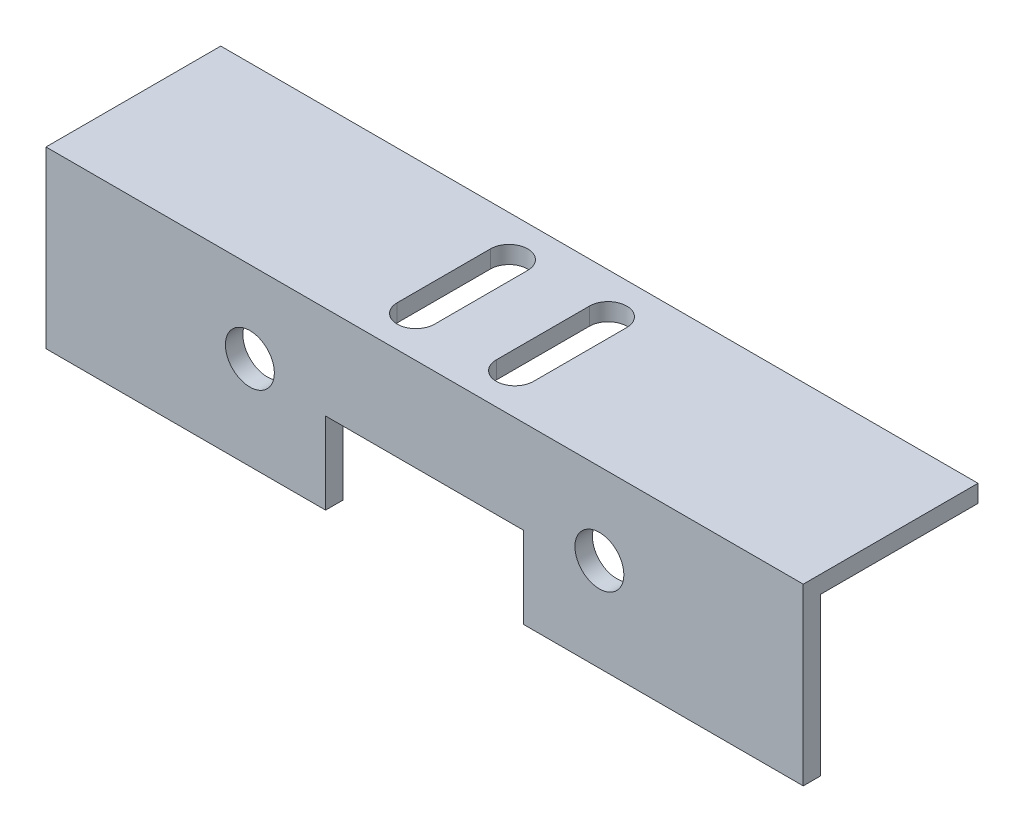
ISO-10303-21;
HEADER;
FILE_DESCRIPTION(('STEP AP214'),'2;1');
FILE_NAME('part.step','',(''),(''),'','','');
FILE_SCHEMA(('AUTOMOTIVE_DESIGN { 1 0 10303 214 1 1 1 1 }'));
ENDSEC;
DATA;
#1=APPLICATION_CONTEXT('core data for automotive mechanical design processes');
#2=APPLICATION_PROTOCOL_DEFINITION('international standard','automotive_design',2000,#1);
#3=PRODUCT_CONTEXT('',#1,'mechanical');
#4=PRODUCT('Part','Part','',(#3));
#5=PRODUCT_RELATED_PRODUCT_CATEGORY('part','',(#4));
#6=PRODUCT_DEFINITION_FORMATION('','',#4);
#7=PRODUCT_DEFINITION_CONTEXT('part definition',#1,'design');
#8=PRODUCT_DEFINITION('design','',#6,#7);
#9=PRODUCT_DEFINITION_SHAPE('','',#8);
#10=(LENGTH_UNIT() NAMED_UNIT(*) SI_UNIT(.MILLI.,.METRE.));
#11=(NAMED_UNIT(*) PLANE_ANGLE_UNIT() SI_UNIT($,.RADIAN.));
#12=(NAMED_UNIT(*) SI_UNIT($,.STERADIAN.) SOLID_ANGLE_UNIT());
#13=UNCERTAINTY_MEASURE_WITH_UNIT(LENGTH_MEASURE(1.E-05),#10,'distance_accuracy_value','');
#14=(GEOMETRIC_REPRESENTATION_CONTEXT(3) GLOBAL_UNCERTAINTY_ASSIGNED_CONTEXT((#13)) GLOBAL_UNIT_ASSIGNED_CONTEXT((#10,
#11,#12)) REPRESENTATION_CONTEXT('',''));
#15=CARTESIAN_POINT('',(0.,0.,0.));
#16=DIRECTION('',(0.,0.,1.));
#17=DIRECTION('',(1.,0.,0.));
#18=AXIS2_PLACEMENT_3D('',#15,#16,#17);
#19=CARTESIAN_POINT('',(65.,0.,-1.5));
#20=DIRECTION('',(0.,1.,0.));
#21=DIRECTION('',(0.,0.,1.));
#22=AXIS2_PLACEMENT_3D('',#19,#20,#21);
#23=PLANE('',#22);
#24=DIRECTION('',(-1.,0.,0.));
#25=VECTOR('',#24,1.);
#26=CARTESIAN_POINT('',(65.,0.,-1.5));
#27=LINE('',#26,#25);
#28=CARTESIAN_POINT('',(24.,0.,-1.5));
#29=VERTEX_POINT('',#28);
#30=CARTESIAN_POINT('',(0.,0.,-1.5));
#31=VERTEX_POINT('',#30);
#32=EDGE_CURVE('E306',#29,#31,#27,.T.);
#33=ORIENTED_EDGE('',*,*,#32,.F.);
#34=DIRECTION('',(0.,0.,1.));
#35=VECTOR('',#34,1.);
#36=CARTESIAN_POINT('',(24.,0.,-1.5));
#37=LINE('',#36,#35);
#38=CARTESIAN_POINT('',(24.,0.,0.));
#39=VERTEX_POINT('',#38);
#40=EDGE_CURVE('E249',#29,#39,#37,.T.);
#41=ORIENTED_EDGE('',*,*,#40,.T.);
#42=DIRECTION('',(-1.,0.,0.));
#43=VECTOR('',#42,1.);
#44=CARTESIAN_POINT('',(65.,0.,0.));
#45=LINE('',#44,#43);
#46=CARTESIAN_POINT('',(0.,0.,0.));
#47=VERTEX_POINT('',#46);
#48=EDGE_CURVE('E279',#39,#47,#45,.T.);
#49=ORIENTED_EDGE('',*,*,#48,.T.);
#50=DIRECTION('',(0.,0.,-1.));
#51=VECTOR('',#50,1.);
#52=CARTESIAN_POINT('',(0.,0.,-1.5));
#53=LINE('',#52,#51);
#54=EDGE_CURVE('E264',#47,#31,#53,.T.);
#55=ORIENTED_EDGE('',*,*,#54,.T.);
#56=EDGE_LOOP('',(#33,#41,#49,#55));
#57=FACE_BOUND('',#56,.T.);
#58=ADVANCED_FACE('F34',(#57),#23,.F.);
#59=CARTESIAN_POINT('',(65.,0.,0.));
#60=VERTEX_POINT('',#59);
#61=CARTESIAN_POINT('',(41.,0.,0.));
#62=VERTEX_POINT('',#61);
#63=EDGE_CURVE('E292',#60,#62,#45,.T.);
#64=ORIENTED_EDGE('',*,*,#63,.T.);
#65=DIRECTION('',(0.,0.,-1.));
#66=VECTOR('',#65,1.);
#67=CARTESIAN_POINT('',(41.,0.,-1.5));
#68=LINE('',#67,#66);
#69=CARTESIAN_POINT('',(41.,0.,-1.5));
#70=VERTEX_POINT('',#69);
#71=EDGE_CURVE('E240',#62,#70,#68,.T.);
#72=ORIENTED_EDGE('',*,*,#71,.T.);
#73=CARTESIAN_POINT('',(65.,0.,-1.5));
#74=VERTEX_POINT('',#73);
#75=EDGE_CURVE('E42',#74,#70,#27,.T.);
#76=ORIENTED_EDGE('',*,*,#75,.F.);
#77=DIRECTION('',(0.,0.,-1.));
#78=VECTOR('',#77,1.);
#79=CARTESIAN_POINT('',(65.,0.,-1.5));
#80=LINE('',#79,#78);
#81=EDGE_CURVE('E265',#60,#74,#80,.T.);
#82=ORIENTED_EDGE('',*,*,#81,.F.);
#83=EDGE_LOOP('',(#64,#72,#76,#82));
#84=FACE_BOUND('',#83,.T.);
#85=ADVANCED_FACE('F36',(#84),#23,.F.);
#86=CARTESIAN_POINT('',(65.,13.5,-1.5));
#87=DIRECTION('',(0.,0.,1.));
#88=DIRECTION('',(0.,-1.,0.));
#89=AXIS2_PLACEMENT_3D('',#86,#87,#88);
#90=PLANE('',#89);
#91=CARTESIAN_POINT('',(47.5,8.,-1.5));
#92=DIRECTION('',(0.,0.,1.));
#93=DIRECTION('',(0.,-1.,0.));
#94=AXIS2_PLACEMENT_3D('',#91,#92,#93);
#95=CIRCLE('',#94,2.1);
#96=CARTESIAN_POINT('',(47.5,5.9,-1.5));
#97=VERTEX_POINT('',#96);
#98=EDGE_CURVE('E255',#97,#97,#95,.T.);
#99=ORIENTED_EDGE('',*,*,#98,.T.);
#100=EDGE_LOOP('',(#99));
#101=FACE_BOUND('',#100,.T.);
#102=CARTESIAN_POINT('',(17.5,8.,-1.5));
#103=DIRECTION('',(0.,0.,1.));
#104=DIRECTION('',(0.,-1.,0.));
#105=AXIS2_PLACEMENT_3D('',#102,#103,#104);
#106=CIRCLE('',#105,2.1);
#107=CARTESIAN_POINT('',(17.5,5.9,-1.5));
#108=VERTEX_POINT('',#107);
#109=EDGE_CURVE('E261',#108,#108,#106,.T.);
#110=ORIENTED_EDGE('',*,*,#109,.T.);
#111=EDGE_LOOP('',(#110));
#112=FACE_BOUND('',#111,.T.);
#113=DIRECTION('',(-1.,0.,0.));
#114=VECTOR('',#113,1.);
#115=CARTESIAN_POINT('',(65.,7.,-1.5));
#116=LINE('',#115,#114);
#117=CARTESIAN_POINT('',(41.,7.,-1.5));
#118=VERTEX_POINT('',#117);
#119=CARTESIAN_POINT('',(24.,7.,-1.5));
#120=VERTEX_POINT('',#119);
#121=EDGE_CURVE('E243',#118,#120,#116,.T.);
#122=ORIENTED_EDGE('',*,*,#121,.T.);
#123=DIRECTION('',(0.,-1.,0.));
#124=VECTOR('',#123,1.);
#125=CARTESIAN_POINT('',(24.,13.5,-1.5));
#126=LINE('',#125,#124);
#127=EDGE_CURVE('E246',#120,#29,#126,.T.);
#128=ORIENTED_EDGE('',*,*,#127,.T.);
#129=ORIENTED_EDGE('',*,*,#32,.T.);
#130=DIRECTION('',(0.,1.,0.));
#131=VECTOR('',#130,1.);
#132=CARTESIAN_POINT('',(0.,13.5,-1.5));
#133=LINE('',#132,#131);
#134=CARTESIAN_POINT('',(0.,13.5,-1.5));
#135=VERTEX_POINT('',#134);
#136=EDGE_CURVE('E282',#31,#135,#133,.T.);
#137=ORIENTED_EDGE('',*,*,#136,.T.);
#138=DIRECTION('',(-1.,0.,0.));
#139=VECTOR('',#138,1.);
#140=CARTESIAN_POINT('',(65.,13.5,-1.5));
#141=LINE('',#140,#139);
#142=CARTESIAN_POINT('',(65.,13.5,-1.5));
#143=VERTEX_POINT('',#142);
#144=EDGE_CURVE('E304',#143,#135,#141,.T.);
#145=ORIENTED_EDGE('',*,*,#144,.F.);
#146=DIRECTION('',(0.,1.,0.));
#147=VECTOR('',#146,1.);
#148=CARTESIAN_POINT('',(65.,13.5,-1.5));
#149=LINE('',#148,#147);
#150=EDGE_CURVE('E268',#74,#143,#149,.T.);
#151=ORIENTED_EDGE('',*,*,#150,.F.);
#152=ORIENTED_EDGE('',*,*,#75,.T.);
#153=DIRECTION('',(0.,1.,0.));
#154=VECTOR('',#153,1.);
#155=CARTESIAN_POINT('',(41.,13.5,-1.5));
#156=LINE('',#155,#154);
#157=EDGE_CURVE('E236',#70,#118,#156,.T.);
#158=ORIENTED_EDGE('',*,*,#157,.T.);
#159=EDGE_LOOP('',(#122,#128,#129,#137,#145,#151,#152,#158));
#160=FACE_BOUND('',#159,.T.);
#161=ADVANCED_FACE('F312',(#101,#112,#160),#90,.F.);
#162=CARTESIAN_POINT('',(65.,13.5,-15.));
#163=DIRECTION('',(0.,1.,0.));
#164=DIRECTION('',(0.,0.,1.));
#165=AXIS2_PLACEMENT_3D('',#162,#163,#164);
#166=PLANE('',#165);
#167=DIRECTION('',(0.,0.,1.));
#168=VECTOR('',#167,1.);
#169=CARTESIAN_POINT('',(35.15,13.5,-15.));
#170=LINE('',#169,#168);
#171=CARTESIAN_POINT('',(35.15,13.5,-11.5));
#172=VERTEX_POINT('',#171);
#173=CARTESIAN_POINT('',(35.15,13.5,-3.5));
#174=VERTEX_POINT('',#173);
#175=EDGE_CURVE('E190',#172,#174,#170,.T.);
#176=ORIENTED_EDGE('',*,*,#175,.T.);
#177=CARTESIAN_POINT('',(36.75,13.5,-3.5));
#178=DIRECTION('',(0.,1.,0.));
#179=DIRECTION('',(0.,0.,1.));
#180=AXIS2_PLACEMENT_3D('',#177,#178,#179);
#181=CIRCLE('',#180,1.6);
#182=CARTESIAN_POINT('',(38.35,13.5,-3.5));
#183=VERTEX_POINT('',#182);
#184=EDGE_CURVE('E193',#174,#183,#181,.T.);
#185=ORIENTED_EDGE('',*,*,#184,.T.);
#186=DIRECTION('',(0.,0.,-1.));
#187=VECTOR('',#186,1.);
#188=CARTESIAN_POINT('',(38.35,13.5,-15.));
#189=LINE('',#188,#187);
#190=CARTESIAN_POINT('',(38.35,13.5,-11.5));
#191=VERTEX_POINT('',#190);
#192=EDGE_CURVE('E185',#183,#191,#189,.T.);
#193=ORIENTED_EDGE('',*,*,#192,.T.);
#194=CARTESIAN_POINT('',(36.75,13.5,-11.5));
#195=DIRECTION('',(0.,1.,0.));
#196=DIRECTION('',(0.,0.,1.));
#197=AXIS2_PLACEMENT_3D('',#194,#195,#196);
#198=CIRCLE('',#197,1.6);
#199=EDGE_CURVE('E165',#191,#172,#198,.T.);
#200=ORIENTED_EDGE('',*,*,#199,.T.);
#201=EDGE_LOOP('',(#176,#185,#193,#200));
#202=FACE_BOUND('',#201,.T.);
#203=DIRECTION('',(0.,0.,1.));
#204=VECTOR('',#203,1.);
#205=CARTESIAN_POINT('',(26.65,13.5,-15.));
#206=LINE('',#205,#204);
#207=CARTESIAN_POINT('',(26.65,13.5,-11.5));
#208=VERTEX_POINT('',#207);
#209=CARTESIAN_POINT('',(26.65,13.5,-3.5));
#210=VERTEX_POINT('',#209);
#211=EDGE_CURVE('E222',#208,#210,#206,.T.);
#212=ORIENTED_EDGE('',*,*,#211,.T.);
#213=CARTESIAN_POINT('',(28.25,13.5,-3.5));
#214=DIRECTION('',(0.,1.,0.));
#215=DIRECTION('',(0.,0.,1.));
#216=AXIS2_PLACEMENT_3D('',#213,#214,#215);
#217=CIRCLE('',#216,1.6);
#218=CARTESIAN_POINT('',(29.85,13.5,-3.5));
#219=VERTEX_POINT('',#218);
#220=EDGE_CURVE('E225',#210,#219,#217,.T.);
#221=ORIENTED_EDGE('',*,*,#220,.T.);
#222=DIRECTION('',(0.,0.,-1.));
#223=VECTOR('',#222,1.);
#224=CARTESIAN_POINT('',(29.85,13.5,-15.));
#225=LINE('',#224,#223);
#226=CARTESIAN_POINT('',(29.85,13.5,-11.5));
#227=VERTEX_POINT('',#226);
#228=EDGE_CURVE('E210',#219,#227,#225,.T.);
#229=ORIENTED_EDGE('',*,*,#228,.T.);
#230=CARTESIAN_POINT('',(28.25,13.5,-11.5));
#231=DIRECTION('',(0.,1.,0.));
#232=DIRECTION('',(0.,0.,1.));
#233=AXIS2_PLACEMENT_3D('',#230,#231,#232);
#234=CIRCLE('',#233,1.6);
#235=EDGE_CURVE('E219',#227,#208,#234,.T.);
#236=ORIENTED_EDGE('',*,*,#235,.T.);
#237=EDGE_LOOP('',(#212,#221,#229,#236));
#238=FACE_BOUND('',#237,.T.);
#239=DIRECTION('',(0.,0.,-1.));
#240=VECTOR('',#239,1.);
#241=CARTESIAN_POINT('',(0.,13.5,-15.));
#242=LINE('',#241,#240);
#243=CARTESIAN_POINT('',(0.,13.5,-15.));
#244=VERTEX_POINT('',#243);
#245=EDGE_CURVE('E284',#135,#244,#242,.T.);
#246=ORIENTED_EDGE('',*,*,#245,.T.);
#247=DIRECTION('',(-1.,0.,0.));
#248=VECTOR('',#247,1.);
#249=CARTESIAN_POINT('',(65.,13.5,-15.));
#250=LINE('',#249,#248);
#251=CARTESIAN_POINT('',(65.,13.5,-15.));
#252=VERTEX_POINT('',#251);
#253=EDGE_CURVE('E301',#252,#244,#250,.T.);
#254=ORIENTED_EDGE('',*,*,#253,.F.);
#255=DIRECTION('',(0.,0.,-1.));
#256=VECTOR('',#255,1.);
#257=CARTESIAN_POINT('',(65.,13.5,-15.));
#258=LINE('',#257,#256);
#259=EDGE_CURVE('E271',#143,#252,#258,.T.);
#260=ORIENTED_EDGE('',*,*,#259,.F.);
#261=ORIENTED_EDGE('',*,*,#144,.T.);
#262=EDGE_LOOP('',(#246,#254,#260,#261));
#263=FACE_BOUND('',#262,.T.);
#264=ADVANCED_FACE('F337',(#202,#238,#263),#166,.F.);
#265=CARTESIAN_POINT('',(65.,15.,-15.));
#266=DIRECTION('',(0.,0.,1.));
#267=DIRECTION('',(1.,0.,0.));
#268=AXIS2_PLACEMENT_3D('',#265,#266,#267);
#269=PLANE('',#268);
#270=DIRECTION('',(0.,1.,0.));
#271=VECTOR('',#270,1.);
#272=CARTESIAN_POINT('',(0.,15.,-15.));
#273=LINE('',#272,#271);
#274=CARTESIAN_POINT('',(0.,15.,-15.));
#275=VERTEX_POINT('',#274);
#276=EDGE_CURVE('E286',#244,#275,#273,.T.);
#277=ORIENTED_EDGE('',*,*,#276,.T.);
#278=DIRECTION('',(-1.,0.,0.));
#279=VECTOR('',#278,1.);
#280=CARTESIAN_POINT('',(65.,15.,-15.));
#281=LINE('',#280,#279);
#282=CARTESIAN_POINT('',(65.,15.,-15.));
#283=VERTEX_POINT('',#282);
#284=EDGE_CURVE('E298',#283,#275,#281,.T.);
#285=ORIENTED_EDGE('',*,*,#284,.F.);
#286=DIRECTION('',(0.,1.,0.));
#287=VECTOR('',#286,1.);
#288=CARTESIAN_POINT('',(65.,15.,-15.));
#289=LINE('',#288,#287);
#290=EDGE_CURVE('E273',#252,#283,#289,.T.);
#291=ORIENTED_EDGE('',*,*,#290,.F.);
#292=ORIENTED_EDGE('',*,*,#253,.T.);
#293=EDGE_LOOP('',(#277,#285,#291,#292));
#294=FACE_BOUND('',#293,.T.);
#295=ADVANCED_FACE('F333',(#294),#269,.F.);
#296=CARTESIAN_POINT('',(65.,15.,0.));
#297=DIRECTION('',(0.,-1.,0.));
#298=DIRECTION('',(0.,0.,-1.));
#299=AXIS2_PLACEMENT_3D('',#296,#297,#298);
#300=PLANE('',#299);
#301=DIRECTION('',(0.,0.,-1.));
#302=VECTOR('',#301,1.);
#303=CARTESIAN_POINT('',(38.35,15.,-3.5));
#304=LINE('',#303,#302);
#305=CARTESIAN_POINT('',(38.35,15.,-3.5));
#306=VERTEX_POINT('',#305);
#307=CARTESIAN_POINT('',(38.35,15.,-11.5));
#308=VERTEX_POINT('',#307);
#309=EDGE_CURVE('E171',#306,#308,#304,.T.);
#310=ORIENTED_EDGE('',*,*,#309,.F.);
#311=CARTESIAN_POINT('',(36.75,15.,-3.5));
#312=DIRECTION('',(0.,1.,0.));
#313=DIRECTION('',(0.,0.,1.));
#314=AXIS2_PLACEMENT_3D('',#311,#312,#313);
#315=CIRCLE('',#314,1.6);
#316=CARTESIAN_POINT('',(35.15,15.,-3.5));
#317=VERTEX_POINT('',#316);
#318=EDGE_CURVE('E57',#317,#306,#315,.T.);
#319=ORIENTED_EDGE('',*,*,#318,.F.);
#320=DIRECTION('',(0.,0.,1.));
#321=VECTOR('',#320,1.);
#322=CARTESIAN_POINT('',(35.15,15.,-3.5));
#323=LINE('',#322,#321);
#324=CARTESIAN_POINT('',(35.15,15.,-11.5));
#325=VERTEX_POINT('',#324);
#326=EDGE_CURVE('E178',#325,#317,#323,.T.);
#327=ORIENTED_EDGE('',*,*,#326,.F.);
#328=CARTESIAN_POINT('',(36.75,15.,-11.5));
#329=DIRECTION('',(0.,1.,0.));
#330=DIRECTION('',(0.,0.,1.));
#331=AXIS2_PLACEMENT_3D('',#328,#329,#330);
#332=CIRCLE('',#331,1.6);
#333=EDGE_CURVE('E162',#308,#325,#332,.T.);
#334=ORIENTED_EDGE('',*,*,#333,.F.);
#335=EDGE_LOOP('',(#310,#319,#327,#334));
#336=FACE_BOUND('',#335,.T.);
#337=DIRECTION('',(0.,0.,-1.));
#338=VECTOR('',#337,1.);
#339=CARTESIAN_POINT('',(29.85,15.,-3.5));
#340=LINE('',#339,#338);
#341=CARTESIAN_POINT('',(29.85,15.,-3.5));
#342=VERTEX_POINT('',#341);
#343=CARTESIAN_POINT('',(29.85,15.,-11.5));
#344=VERTEX_POINT('',#343);
#345=EDGE_CURVE('E198',#342,#344,#340,.T.);
#346=ORIENTED_EDGE('',*,*,#345,.F.);
#347=CARTESIAN_POINT('',(28.25,15.,-3.5));
#348=DIRECTION('',(0.,1.,0.));
#349=DIRECTION('',(0.,0.,1.));
#350=AXIS2_PLACEMENT_3D('',#347,#348,#349);
#351=CIRCLE('',#350,1.6);
#352=CARTESIAN_POINT('',(26.65,15.,-3.5));
#353=VERTEX_POINT('',#352);
#354=EDGE_CURVE('E196',#353,#342,#351,.T.);
#355=ORIENTED_EDGE('',*,*,#354,.F.);
#356=DIRECTION('',(0.,0.,1.));
#357=VECTOR('',#356,1.);
#358=CARTESIAN_POINT('',(26.65,15.,-3.5));
#359=LINE('',#358,#357);
#360=CARTESIAN_POINT('',(26.65,15.,-11.5));
#361=VERTEX_POINT('',#360);
#362=EDGE_CURVE('E204',#361,#353,#359,.T.);
#363=ORIENTED_EDGE('',*,*,#362,.F.);
#364=CARTESIAN_POINT('',(28.25,15.,-11.5));
#365=DIRECTION('',(0.,1.,0.));
#366=DIRECTION('',(0.,0.,1.));
#367=AXIS2_PLACEMENT_3D('',#364,#365,#366);
#368=CIRCLE('',#367,1.6);
#369=EDGE_CURVE('E201',#344,#361,#368,.T.);
#370=ORIENTED_EDGE('',*,*,#369,.F.);
#371=EDGE_LOOP('',(#346,#355,#363,#370));
#372=FACE_BOUND('',#371,.T.);
#373=DIRECTION('',(0.,0.,1.));
#374=VECTOR('',#373,1.);
#375=CARTESIAN_POINT('',(0.,15.,0.));
#376=LINE('',#375,#374);
#377=CARTESIAN_POINT('',(0.,15.,0.));
#378=VERTEX_POINT('',#377);
#379=EDGE_CURVE('E288',#275,#378,#376,.T.);
#380=ORIENTED_EDGE('',*,*,#379,.T.);
#381=DIRECTION('',(-1.,0.,0.));
#382=VECTOR('',#381,1.);
#383=CARTESIAN_POINT('',(65.,15.,0.));
#384=LINE('',#383,#382);
#385=CARTESIAN_POINT('',(65.,15.,0.));
#386=VERTEX_POINT('',#385);
#387=EDGE_CURVE('E295',#386,#378,#384,.T.);
#388=ORIENTED_EDGE('',*,*,#387,.F.);
#389=DIRECTION('',(0.,0.,1.));
#390=VECTOR('',#389,1.);
#391=CARTESIAN_POINT('',(65.,15.,0.));
#392=LINE('',#391,#390);
#393=EDGE_CURVE('E275',#283,#386,#392,.T.);
#394=ORIENTED_EDGE('',*,*,#393,.F.);
#395=ORIENTED_EDGE('',*,*,#284,.T.);
#396=EDGE_LOOP('',(#380,#388,#394,#395));
#397=FACE_BOUND('',#396,.T.);
#398=ADVANCED_FACE('F175',(#336,#372,#397),#300,.F.);
#399=CARTESIAN_POINT('',(65.,0.,0.));
#400=DIRECTION('',(0.,0.,-1.));
#401=DIRECTION('',(-1.,0.,0.));
#402=AXIS2_PLACEMENT_3D('',#399,#400,#401);
#403=PLANE('',#402);
#404=CARTESIAN_POINT('',(47.5,8.,0.));
#405=DIRECTION('',(0.,0.,1.));
#406=DIRECTION('',(1.,0.,0.));
#407=AXIS2_PLACEMENT_3D('',#404,#405,#406);
#408=CIRCLE('',#407,2.1);
#409=CARTESIAN_POINT('',(49.6,8.,0.));
#410=VERTEX_POINT('',#409);
#411=EDGE_CURVE('E252',#410,#410,#408,.T.);
#412=ORIENTED_EDGE('',*,*,#411,.F.);
#413=EDGE_LOOP('',(#412));
#414=FACE_BOUND('',#413,.T.);
#415=CARTESIAN_POINT('',(17.5,8.,0.));
#416=DIRECTION('',(0.,0.,1.));
#417=DIRECTION('',(1.,0.,0.));
#418=AXIS2_PLACEMENT_3D('',#415,#416,#417);
#419=CIRCLE('',#418,2.1);
#420=CARTESIAN_POINT('',(19.6,8.,0.));
#421=VERTEX_POINT('',#420);
#422=EDGE_CURVE('E258',#421,#421,#419,.T.);
#423=ORIENTED_EDGE('',*,*,#422,.F.);
#424=EDGE_LOOP('',(#423));
#425=FACE_BOUND('',#424,.T.);
#426=ORIENTED_EDGE('',*,*,#48,.F.);
#427=DIRECTION('',(0.,-1.,0.));
#428=VECTOR('',#427,1.);
#429=CARTESIAN_POINT('',(24.,7.,0.));
#430=LINE('',#429,#428);
#431=CARTESIAN_POINT('',(24.,7.,0.));
#432=VERTEX_POINT('',#431);
#433=EDGE_CURVE('E228',#432,#39,#430,.T.);
#434=ORIENTED_EDGE('',*,*,#433,.F.);
#435=DIRECTION('',(-1.,0.,0.));
#436=VECTOR('',#435,1.);
#437=CARTESIAN_POINT('',(24.,7.,0.));
#438=LINE('',#437,#436);
#439=CARTESIAN_POINT('',(41.,7.,0.));
#440=VERTEX_POINT('',#439);
#441=EDGE_CURVE('E230',#440,#432,#438,.T.);
#442=ORIENTED_EDGE('',*,*,#441,.F.);
#443=DIRECTION('',(0.,-1.,0.));
#444=VECTOR('',#443,1.);
#445=CARTESIAN_POINT('',(41.,0.,0.));
#446=LINE('',#445,#444);
#447=EDGE_CURVE('E11',#440,#62,#446,.T.);
#448=ORIENTED_EDGE('',*,*,#447,.T.);
#449=ORIENTED_EDGE('',*,*,#63,.F.);
#450=DIRECTION('',(0.,-1.,0.));
#451=VECTOR('',#450,1.);
#452=CARTESIAN_POINT('',(65.,0.,0.));
#453=LINE('',#452,#451);
#454=EDGE_CURVE('E277',#386,#60,#453,.T.);
#455=ORIENTED_EDGE('',*,*,#454,.F.);
#456=ORIENTED_EDGE('',*,*,#387,.T.);
#457=DIRECTION('',(0.,-1.,0.));
#458=VECTOR('',#457,1.);
#459=CARTESIAN_POINT('',(0.,0.,0.));
#460=LINE('',#459,#458);
#461=EDGE_CURVE('E269',#378,#47,#460,.T.);
#462=ORIENTED_EDGE('',*,*,#461,.T.);
#463=EDGE_LOOP('',(#426,#434,#442,#448,#449,#455,#456,#462));
#464=FACE_BOUND('',#463,.T.);
#465=ADVANCED_FACE('F324',(#414,#425,#464),#403,.F.);
#466=CARTESIAN_POINT('',(65.,0.,0.));
#467=DIRECTION('',(-1.,0.,0.));
#468=DIRECTION('',(0.,0.,1.));
#469=AXIS2_PLACEMENT_3D('',#466,#467,#468);
#470=PLANE('',#469);
#471=ORIENTED_EDGE('',*,*,#81,.T.);
#472=ORIENTED_EDGE('',*,*,#150,.T.);
#473=ORIENTED_EDGE('',*,*,#259,.T.);
#474=ORIENTED_EDGE('',*,*,#290,.T.);
#475=ORIENTED_EDGE('',*,*,#393,.T.);
#476=ORIENTED_EDGE('',*,*,#454,.T.);
#477=EDGE_LOOP('',(#471,#472,#473,#474,#475,#476));
#478=FACE_BOUND('',#477,.T.);
#479=ADVANCED_FACE('F340',(#478),#470,.F.);
#480=CARTESIAN_POINT('',(0.,0.,0.));
#481=DIRECTION('',(-1.,0.,0.));
#482=DIRECTION('',(0.,0.,1.));
#483=AXIS2_PLACEMENT_3D('',#480,#481,#482);
#484=PLANE('',#483);
#485=ORIENTED_EDGE('',*,*,#54,.F.);
#486=ORIENTED_EDGE('',*,*,#461,.F.);
#487=ORIENTED_EDGE('',*,*,#379,.F.);
#488=ORIENTED_EDGE('',*,*,#276,.F.);
#489=ORIENTED_EDGE('',*,*,#245,.F.);
#490=ORIENTED_EDGE('',*,*,#136,.F.);
#491=EDGE_LOOP('',(#485,#486,#487,#488,#489,#490));
#492=FACE_BOUND('',#491,.T.);
#493=ADVANCED_FACE('F318',(#492),#484,.T.);
#494=CARTESIAN_POINT('',(17.5,8.,-15.));
#495=DIRECTION('',(0.,0.,1.));
#496=DIRECTION('',(1.,0.,0.));
#497=AXIS2_PLACEMENT_3D('',#494,#495,#496);
#498=CYLINDRICAL_SURFACE('',#497,2.1);
#499=ORIENTED_EDGE('',*,*,#422,.T.);
#500=EDGE_LOOP('',(#499));
#501=FACE_BOUND('',#500,.T.);
#502=ORIENTED_EDGE('',*,*,#109,.F.);
#503=EDGE_LOOP('',(#502));
#504=FACE_BOUND('',#503,.T.);
#505=ADVANCED_FACE('F361',(#501,#504),#498,.F.);
#506=CARTESIAN_POINT('',(47.5,8.,-15.));
#507=DIRECTION('',(0.,0.,1.));
#508=DIRECTION('',(1.,0.,0.));
#509=AXIS2_PLACEMENT_3D('',#506,#507,#508);
#510=CYLINDRICAL_SURFACE('',#509,2.1);
#511=ORIENTED_EDGE('',*,*,#411,.T.);
#512=EDGE_LOOP('',(#511));
#513=FACE_BOUND('',#512,.T.);
#514=ORIENTED_EDGE('',*,*,#98,.F.);
#515=EDGE_LOOP('',(#514));
#516=FACE_BOUND('',#515,.T.);
#517=ADVANCED_FACE('F354',(#513,#516),#510,.F.);
#518=CARTESIAN_POINT('',(24.,7.,-15.));
#519=DIRECTION('',(-1.,0.,0.));
#520=DIRECTION('',(0.,0.,1.));
#521=AXIS2_PLACEMENT_3D('',#518,#519,#520);
#522=PLANE('',#521);
#523=ORIENTED_EDGE('',*,*,#127,.F.);
#524=DIRECTION('',(0.,0.,1.));
#525=VECTOR('',#524,1.);
#526=CARTESIAN_POINT('',(24.,7.,-15.));
#527=LINE('',#526,#525);
#528=EDGE_CURVE('E234',#120,#432,#527,.T.);
#529=ORIENTED_EDGE('',*,*,#528,.T.);
#530=ORIENTED_EDGE('',*,*,#433,.T.);
#531=ORIENTED_EDGE('',*,*,#40,.F.);
#532=EDGE_LOOP('',(#523,#529,#530,#531));
#533=FACE_BOUND('',#532,.T.);
#534=ADVANCED_FACE('F352',(#533),#522,.F.);
#535=CARTESIAN_POINT('',(24.,7.,-15.));
#536=DIRECTION('',(0.,1.,0.));
#537=DIRECTION('',(0.,0.,1.));
#538=AXIS2_PLACEMENT_3D('',#535,#536,#537);
#539=PLANE('',#538);
#540=DIRECTION('',(0.,0.,1.));
#541=VECTOR('',#540,1.);
#542=CARTESIAN_POINT('',(41.,7.,-15.));
#543=LINE('',#542,#541);
#544=EDGE_CURVE('E233',#118,#440,#543,.T.);
#545=ORIENTED_EDGE('',*,*,#544,.T.);
#546=ORIENTED_EDGE('',*,*,#441,.T.);
#547=ORIENTED_EDGE('',*,*,#528,.F.);
#548=ORIENTED_EDGE('',*,*,#121,.F.);
#549=EDGE_LOOP('',(#545,#546,#547,#548));
#550=FACE_BOUND('',#549,.T.);
#551=ADVANCED_FACE('F350',(#550),#539,.F.);
#552=CARTESIAN_POINT('',(41.,7.,-15.));
#553=DIRECTION('',(1.,0.,0.));
#554=DIRECTION('',(0.,0.,-1.));
#555=AXIS2_PLACEMENT_3D('',#552,#553,#554);
#556=PLANE('',#555);
#557=ORIENTED_EDGE('',*,*,#447,.F.);
#558=ORIENTED_EDGE('',*,*,#544,.F.);
#559=ORIENTED_EDGE('',*,*,#157,.F.);
#560=ORIENTED_EDGE('',*,*,#71,.F.);
#561=EDGE_LOOP('',(#557,#558,#559,#560));
#562=FACE_BOUND('',#561,.T.);
#563=ADVANCED_FACE('F345',(#562),#556,.F.);
#564=CARTESIAN_POINT('',(28.25,0.,-3.5));
#565=DIRECTION('',(0.,1.,0.));
#566=DIRECTION('',(0.,0.,1.));
#567=AXIS2_PLACEMENT_3D('',#564,#565,#566);
#568=CYLINDRICAL_SURFACE('',#567,1.6);
#569=DIRECTION('',(0.,1.,0.));
#570=VECTOR('',#569,1.);
#571=CARTESIAN_POINT('',(26.65,0.,-3.5));
#572=LINE('',#571,#570);
#573=EDGE_CURVE('E208',#210,#353,#572,.T.);
#574=ORIENTED_EDGE('',*,*,#573,.T.);
#575=ORIENTED_EDGE('',*,*,#354,.T.);
#576=DIRECTION('',(0.,1.,0.));
#577=VECTOR('',#576,1.);
#578=CARTESIAN_POINT('',(29.85,0.,-3.5));
#579=LINE('',#578,#577);
#580=EDGE_CURVE('E207',#219,#342,#579,.T.);
#581=ORIENTED_EDGE('',*,*,#580,.F.);
#582=ORIENTED_EDGE('',*,*,#220,.F.);
#583=EDGE_LOOP('',(#574,#575,#581,#582));
#584=FACE_BOUND('',#583,.T.);
#585=ADVANCED_FACE('F425',(#584),#568,.F.);
#586=CARTESIAN_POINT('',(26.65,0.,-3.5));
#587=DIRECTION('',(-1.,0.,0.));
#588=DIRECTION('',(0.,0.,1.));
#589=AXIS2_PLACEMENT_3D('',#586,#587,#588);
#590=PLANE('',#589);
#591=DIRECTION('',(0.,1.,0.));
#592=VECTOR('',#591,1.);
#593=CARTESIAN_POINT('',(26.65,0.,-11.5));
#594=LINE('',#593,#592);
#595=EDGE_CURVE('E211',#208,#361,#594,.T.);
#596=ORIENTED_EDGE('',*,*,#595,.T.);
#597=ORIENTED_EDGE('',*,*,#362,.T.);
#598=ORIENTED_EDGE('',*,*,#573,.F.);
#599=ORIENTED_EDGE('',*,*,#211,.F.);
#600=EDGE_LOOP('',(#596,#597,#598,#599));
#601=FACE_BOUND('',#600,.T.);
#602=ADVANCED_FACE('F448',(#601),#590,.F.);
#603=CARTESIAN_POINT('',(28.25,0.,-11.5));
#604=DIRECTION('',(0.,1.,0.));
#605=DIRECTION('',(0.,0.,1.));
#606=AXIS2_PLACEMENT_3D('',#603,#604,#605);
#607=CYLINDRICAL_SURFACE('',#606,1.6);
#608=DIRECTION('',(0.,1.,0.));
#609=VECTOR('',#608,1.);
#610=CARTESIAN_POINT('',(29.85,0.,-11.5));
#611=LINE('',#610,#609);
#612=EDGE_CURVE('E213',#227,#344,#611,.T.);
#613=ORIENTED_EDGE('',*,*,#612,.T.);
#614=ORIENTED_EDGE('',*,*,#369,.T.);
#615=ORIENTED_EDGE('',*,*,#595,.F.);
#616=ORIENTED_EDGE('',*,*,#235,.F.);
#617=EDGE_LOOP('',(#613,#614,#615,#616));
#618=FACE_BOUND('',#617,.T.);
#619=ADVANCED_FACE('F458',(#618),#607,.F.);
#620=CARTESIAN_POINT('',(29.85,0.,-3.5));
#621=DIRECTION('',(1.,0.,0.));
#622=DIRECTION('',(0.,0.,-1.));
#623=AXIS2_PLACEMENT_3D('',#620,#621,#622);
#624=PLANE('',#623);
#625=ORIENTED_EDGE('',*,*,#580,.T.);
#626=ORIENTED_EDGE('',*,*,#345,.T.);
#627=ORIENTED_EDGE('',*,*,#612,.F.);
#628=ORIENTED_EDGE('',*,*,#228,.F.);
#629=EDGE_LOOP('',(#625,#626,#627,#628));
#630=FACE_BOUND('',#629,.T.);
#631=ADVANCED_FACE('F468',(#630),#624,.F.);
#632=CARTESIAN_POINT('',(36.75,0.,-3.5));
#633=DIRECTION('',(0.,1.,0.));
#634=DIRECTION('',(0.,0.,1.));
#635=AXIS2_PLACEMENT_3D('',#632,#633,#634);
#636=CYLINDRICAL_SURFACE('',#635,1.6);
#637=DIRECTION('',(0.,1.,0.));
#638=VECTOR('',#637,1.);
#639=CARTESIAN_POINT('',(35.15,0.,-3.5));
#640=LINE('',#639,#638);
#641=EDGE_CURVE('E183',#174,#317,#640,.T.);
#642=ORIENTED_EDGE('',*,*,#641,.T.);
#643=ORIENTED_EDGE('',*,*,#318,.T.);
#644=DIRECTION('',(0.,1.,0.));
#645=VECTOR('',#644,1.);
#646=CARTESIAN_POINT('',(38.35,0.,-3.5));
#647=LINE('',#646,#645);
#648=EDGE_CURVE('E168',#183,#306,#647,.T.);
#649=ORIENTED_EDGE('',*,*,#648,.F.);
#650=ORIENTED_EDGE('',*,*,#184,.F.);
#651=EDGE_LOOP('',(#642,#643,#649,#650));
#652=FACE_BOUND('',#651,.T.);
#653=ADVANCED_FACE('F478',(#652),#636,.F.);
#654=CARTESIAN_POINT('',(35.15,0.,-3.5));
#655=DIRECTION('',(-1.,0.,0.));
#656=DIRECTION('',(0.,0.,1.));
#657=AXIS2_PLACEMENT_3D('',#654,#655,#656);
#658=PLANE('',#657);
#659=DIRECTION('',(0.,1.,0.));
#660=VECTOR('',#659,1.);
#661=CARTESIAN_POINT('',(35.15,0.,-11.5));
#662=LINE('',#661,#660);
#663=EDGE_CURVE('E167',#172,#325,#662,.T.);
#664=ORIENTED_EDGE('',*,*,#663,.T.);
#665=ORIENTED_EDGE('',*,*,#326,.T.);
#666=ORIENTED_EDGE('',*,*,#641,.F.);
#667=ORIENTED_EDGE('',*,*,#175,.F.);
#668=EDGE_LOOP('',(#664,#665,#666,#667));
#669=FACE_BOUND('',#668,.T.);
#670=ADVANCED_FACE('F488',(#669),#658,.F.);
#671=CARTESIAN_POINT('',(36.75,0.,-11.5));
#672=DIRECTION('',(0.,1.,0.));
#673=DIRECTION('',(0.,0.,1.));
#674=AXIS2_PLACEMENT_3D('',#671,#672,#673);
#675=CYLINDRICAL_SURFACE('',#674,1.6);
#676=DIRECTION('',(0.,1.,0.));
#677=VECTOR('',#676,1.);
#678=CARTESIAN_POINT('',(38.35,0.,-11.5));
#679=LINE('',#678,#677);
#680=EDGE_CURVE('E49',#191,#308,#679,.T.);
#681=ORIENTED_EDGE('',*,*,#680,.T.);
#682=ORIENTED_EDGE('',*,*,#333,.T.);
#683=ORIENTED_EDGE('',*,*,#663,.F.);
#684=ORIENTED_EDGE('',*,*,#199,.F.);
#685=EDGE_LOOP('',(#681,#682,#683,#684));
#686=FACE_BOUND('',#685,.T.);
#687=ADVANCED_FACE('F159',(#686),#675,.F.);
#688=CARTESIAN_POINT('',(38.35,0.,-3.5));
#689=DIRECTION('',(1.,0.,0.));
#690=DIRECTION('',(0.,0.,-1.));
#691=AXIS2_PLACEMENT_3D('',#688,#689,#690);
#692=PLANE('',#691);
#693=ORIENTED_EDGE('',*,*,#648,.T.);
#694=ORIENTED_EDGE('',*,*,#309,.T.);
#695=ORIENTED_EDGE('',*,*,#680,.F.);
#696=ORIENTED_EDGE('',*,*,#192,.F.);
#697=EDGE_LOOP('',(#693,#694,#695,#696));
#698=FACE_BOUND('',#697,.T.);
#699=ADVANCED_FACE('F172',(#698),#692,.F.);
#700=CLOSED_SHELL('',(#58,#85,#161,#264,#295,#398,#465,#479,#493,#505,#517,#534,#551,#563,#585,
#602,#619,#631,#653,#670,#687,#699));
#701=MANIFOLD_SOLID_BREP('B2',#700);
#702=ADVANCED_BREP_SHAPE_REPRESENTATION('',(#18,#701),#14);
#703=SHAPE_DEFINITION_REPRESENTATION(#9,#702);
ENDSEC;
END-ISO-10303-21;
